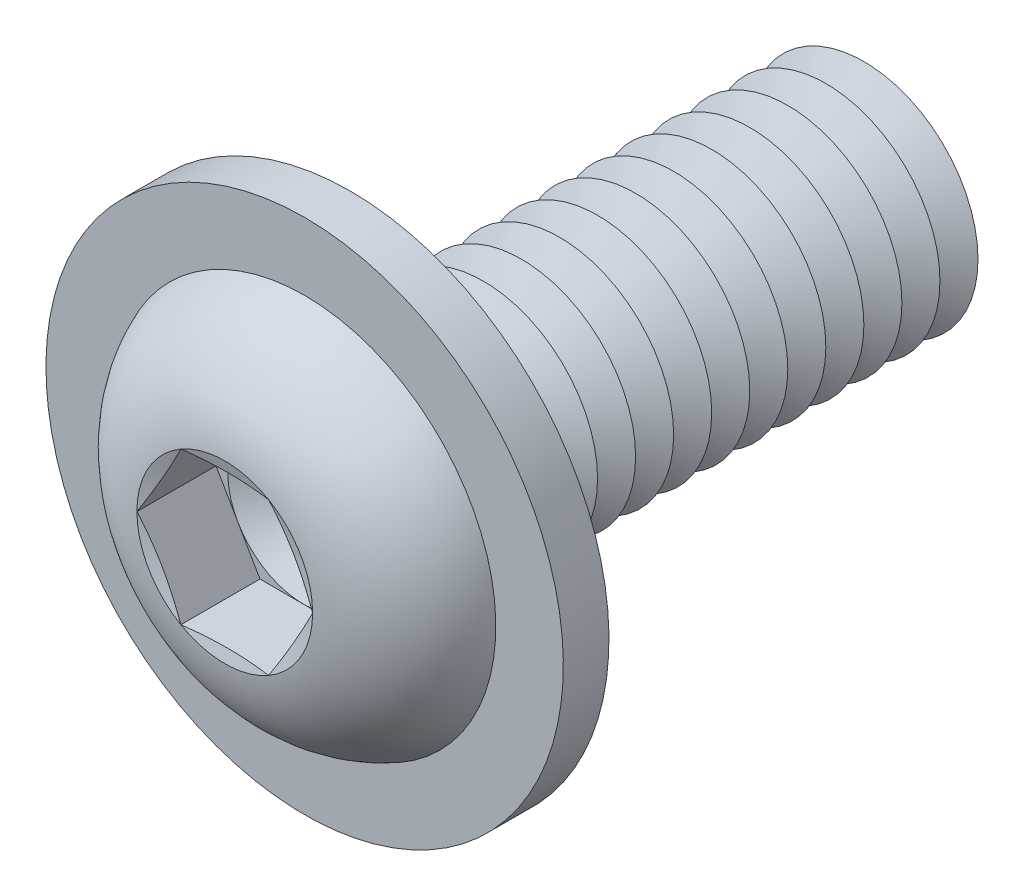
ISO-10303-21;
HEADER;
FILE_DESCRIPTION(('STEP AP214'),'2;1');
FILE_NAME('part.step','',(''),(''),'','','');
FILE_SCHEMA(('AUTOMOTIVE_DESIGN { 1 0 10303 214 1 1 1 1 }'));
ENDSEC;
DATA;
#1=APPLICATION_CONTEXT('core data for automotive mechanical design processes');
#2=APPLICATION_PROTOCOL_DEFINITION('international standard','automotive_design',2000,#1);
#3=PRODUCT_CONTEXT('',#1,'mechanical');
#4=PRODUCT('Part','Part','',(#3));
#5=PRODUCT_RELATED_PRODUCT_CATEGORY('part','',(#4));
#6=PRODUCT_DEFINITION_FORMATION('','',#4);
#7=PRODUCT_DEFINITION_CONTEXT('part definition',#1,'design');
#8=PRODUCT_DEFINITION('design','',#6,#7);
#9=PRODUCT_DEFINITION_SHAPE('','',#8);
#10=(LENGTH_UNIT() NAMED_UNIT(*) SI_UNIT(.MILLI.,.METRE.));
#11=(NAMED_UNIT(*) PLANE_ANGLE_UNIT() SI_UNIT($,.RADIAN.));
#12=(NAMED_UNIT(*) SI_UNIT($,.STERADIAN.) SOLID_ANGLE_UNIT());
#13=UNCERTAINTY_MEASURE_WITH_UNIT(LENGTH_MEASURE(1.E-05),#10,'distance_accuracy_value','');
#14=(GEOMETRIC_REPRESENTATION_CONTEXT(3) GLOBAL_UNCERTAINTY_ASSIGNED_CONTEXT((#13)) GLOBAL_UNIT_ASSIGNED_CONTEXT((#10,
#11,#12)) REPRESENTATION_CONTEXT('',''));
#15=CARTESIAN_POINT('',(0.,0.,0.));
#16=DIRECTION('',(0.,0.,1.));
#17=DIRECTION('',(1.,0.,0.));
#18=AXIS2_PLACEMENT_3D('',#15,#16,#17);
#19=CARTESIAN_POINT('',(0.,0.,-10.5));
#20=DIRECTION('',(0.,0.,1.));
#21=DIRECTION('',(1.,0.,0.));
#22=AXIS2_PLACEMENT_3D('',#19,#20,#21);
#23=CONICAL_SURFACE('',#22,3.,1.0471975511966);
#24=CARTESIAN_POINT('',(0.,0.,-11.));
#25=DIRECTION('',(0.,0.,1.));
#26=DIRECTION('',(1.,0.,0.));
#27=AXIS2_PLACEMENT_3D('',#24,#25,#26);
#28=CIRCLE('',#27,2.13397459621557);
#29=CARTESIAN_POINT('',(2.13397459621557,0.,-11.));
#30=VERTEX_POINT('',#29);
#31=EDGE_CURVE('E322',#30,#30,#28,.T.);
#32=ORIENTED_EDGE('',*,*,#31,.T.);
#33=EDGE_LOOP('',(#32));
#34=FACE_BOUND('',#33,.T.);
#35=CARTESIAN_POINT('',(0.,0.,-10.5));
#36=DIRECTION('',(0.,0.,1.));
#37=DIRECTION('',(1.,0.,0.));
#38=AXIS2_PLACEMENT_3D('',#35,#36,#37);
#39=CIRCLE('',#38,3.);
#40=CARTESIAN_POINT('',(3.,0.,-10.5));
#41=VERTEX_POINT('',#40);
#42=EDGE_CURVE('E318',#41,#41,#39,.T.);
#43=ORIENTED_EDGE('',*,*,#42,.F.);
#44=EDGE_LOOP('',(#43));
#45=FACE_BOUND('',#44,.T.);
#46=ADVANCED_FACE('F39',(#34,#45),#23,.T.);
#47=CARTESIAN_POINT('',(0.,0.,-11.));
#48=DIRECTION('',(0.,0.,-1.));
#49=DIRECTION('',(-1.,0.,0.));
#50=AXIS2_PLACEMENT_3D('',#47,#48,#49);
#51=CONICAL_SURFACE('',#50,2.13397459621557,1.0471975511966);
#52=CARTESIAN_POINT('',(0.,0.,-11.5));
#53=DIRECTION('',(0.,0.,1.));
#54=DIRECTION('',(1.,0.,0.));
#55=AXIS2_PLACEMENT_3D('',#52,#53,#54);
#56=CIRCLE('',#55,3.);
#57=CARTESIAN_POINT('',(3.,0.,-11.5));
#58=VERTEX_POINT('',#57);
#59=EDGE_CURVE('E326',#58,#58,#56,.T.);
#60=ORIENTED_EDGE('',*,*,#59,.T.);
#61=EDGE_LOOP('',(#60));
#62=FACE_BOUND('',#61,.T.);
#63=ORIENTED_EDGE('',*,*,#31,.F.);
#64=EDGE_LOOP('',(#63));
#65=FACE_BOUND('',#64,.T.);
#66=ADVANCED_FACE('F449',(#62,#65),#51,.T.);
#67=CARTESIAN_POINT('',(0.,3.00000000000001,-14.));
#68=DIRECTION('',(0.,0.,-1.));
#69=DIRECTION('',(-1.,0.,0.));
#70=AXIS2_PLACEMENT_3D('',#67,#68,#69);
#71=PLANE('',#70);
#72=CARTESIAN_POINT('',(0.,0.,-14.));
#73=DIRECTION('',(0.,0.,1.));
#74=DIRECTION('',(1.,0.,0.));
#75=AXIS2_PLACEMENT_3D('',#72,#73,#74);
#76=CIRCLE('',#75,2.13397459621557);
#77=CARTESIAN_POINT('',(2.13397459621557,0.,-14.));
#78=VERTEX_POINT('',#77);
#79=EDGE_CURVE('E346',#78,#78,#76,.T.);
#80=ORIENTED_EDGE('',*,*,#79,.F.);
#81=EDGE_LOOP('',(#80));
#82=FACE_BOUND('',#81,.T.);
#83=ADVANCED_FACE('F455',(#82),#71,.T.);
#84=CARTESIAN_POINT('',(0.,0.,-13.5));
#85=DIRECTION('',(0.,0.,1.));
#86=DIRECTION('',(1.,0.,0.));
#87=AXIS2_PLACEMENT_3D('',#84,#85,#86);
#88=CONICAL_SURFACE('',#87,3.,1.0471975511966);
#89=ORIENTED_EDGE('',*,*,#79,.T.);
#90=EDGE_LOOP('',(#89));
#91=FACE_BOUND('',#90,.T.);
#92=CARTESIAN_POINT('',(0.,0.,-13.5));
#93=DIRECTION('',(0.,0.,1.));
#94=DIRECTION('',(1.,0.,0.));
#95=AXIS2_PLACEMENT_3D('',#92,#93,#94);
#96=CIRCLE('',#95,3.);
#97=CARTESIAN_POINT('',(3.,0.,-13.5));
#98=VERTEX_POINT('',#97);
#99=EDGE_CURVE('E342',#98,#98,#96,.T.);
#100=ORIENTED_EDGE('',*,*,#99,.F.);
#101=EDGE_LOOP('',(#100));
#102=FACE_BOUND('',#101,.T.);
#103=ADVANCED_FACE('F474',(#91,#102),#88,.T.);
#104=CARTESIAN_POINT('',(0.,0.,-13.));
#105=DIRECTION('',(0.,0.,-1.));
#106=DIRECTION('',(-1.,0.,0.));
#107=AXIS2_PLACEMENT_3D('',#104,#105,#106);
#108=CONICAL_SURFACE('',#107,2.13397459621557,1.0471975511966);
#109=ORIENTED_EDGE('',*,*,#99,.T.);
#110=EDGE_LOOP('',(#109));
#111=FACE_BOUND('',#110,.T.);
#112=CARTESIAN_POINT('',(0.,0.,-13.));
#113=DIRECTION('',(0.,0.,1.));
#114=DIRECTION('',(1.,0.,0.));
#115=AXIS2_PLACEMENT_3D('',#112,#113,#114);
#116=CIRCLE('',#115,2.13397459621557);
#117=CARTESIAN_POINT('',(2.13397459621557,0.,-13.));
#118=VERTEX_POINT('',#117);
#119=EDGE_CURVE('E338',#118,#118,#116,.T.);
#120=ORIENTED_EDGE('',*,*,#119,.F.);
#121=EDGE_LOOP('',(#120));
#122=FACE_BOUND('',#121,.T.);
#123=ADVANCED_FACE('F471',(#111,#122),#108,.T.);
#124=CARTESIAN_POINT('',(0.,0.,-12.5));
#125=DIRECTION('',(0.,0.,1.));
#126=DIRECTION('',(1.,0.,0.));
#127=AXIS2_PLACEMENT_3D('',#124,#125,#126);
#128=CONICAL_SURFACE('',#127,3.,1.0471975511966);
#129=ORIENTED_EDGE('',*,*,#119,.T.);
#130=EDGE_LOOP('',(#129));
#131=FACE_BOUND('',#130,.T.);
#132=CARTESIAN_POINT('',(0.,0.,-12.5));
#133=DIRECTION('',(0.,0.,1.));
#134=DIRECTION('',(1.,0.,0.));
#135=AXIS2_PLACEMENT_3D('',#132,#133,#134);
#136=CIRCLE('',#135,3.);
#137=CARTESIAN_POINT('',(3.,0.,-12.5));
#138=VERTEX_POINT('',#137);
#139=EDGE_CURVE('E334',#138,#138,#136,.T.);
#140=ORIENTED_EDGE('',*,*,#139,.F.);
#141=EDGE_LOOP('',(#140));
#142=FACE_BOUND('',#141,.T.);
#143=ADVANCED_FACE('F465',(#131,#142),#128,.T.);
#144=CARTESIAN_POINT('',(0.,0.,-12.));
#145=DIRECTION('',(0.,0.,-1.));
#146=DIRECTION('',(-1.,0.,0.));
#147=AXIS2_PLACEMENT_3D('',#144,#145,#146);
#148=CONICAL_SURFACE('',#147,2.13397459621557,1.0471975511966);
#149=ORIENTED_EDGE('',*,*,#139,.T.);
#150=EDGE_LOOP('',(#149));
#151=FACE_BOUND('',#150,.T.);
#152=CARTESIAN_POINT('',(0.,0.,-12.));
#153=DIRECTION('',(0.,0.,1.));
#154=DIRECTION('',(1.,0.,0.));
#155=AXIS2_PLACEMENT_3D('',#152,#153,#154);
#156=CIRCLE('',#155,2.13397459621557);
#157=CARTESIAN_POINT('',(2.13397459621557,0.,-12.));
#158=VERTEX_POINT('',#157);
#159=EDGE_CURVE('E330',#158,#158,#156,.T.);
#160=ORIENTED_EDGE('',*,*,#159,.F.);
#161=EDGE_LOOP('',(#160));
#162=FACE_BOUND('',#161,.T.);
#163=ADVANCED_FACE('F461',(#151,#162),#148,.T.);
#164=CARTESIAN_POINT('',(0.,0.,-11.5));
#165=DIRECTION('',(0.,0.,1.));
#166=DIRECTION('',(1.,0.,0.));
#167=AXIS2_PLACEMENT_3D('',#164,#165,#166);
#168=CONICAL_SURFACE('',#167,3.,1.0471975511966);
#169=ORIENTED_EDGE('',*,*,#159,.T.);
#170=EDGE_LOOP('',(#169));
#171=FACE_BOUND('',#170,.T.);
#172=ORIENTED_EDGE('',*,*,#59,.F.);
#173=EDGE_LOOP('',(#172));
#174=FACE_BOUND('',#173,.T.);
#175=ADVANCED_FACE('F464',(#171,#174),#168,.T.);
#176=CARTESIAN_POINT('',(0.,0.,-9.5));
#177=DIRECTION('',(0.,0.,1.));
#178=DIRECTION('',(1.,0.,0.));
#179=AXIS2_PLACEMENT_3D('',#176,#177,#178);
#180=CONICAL_SURFACE('',#179,3.,1.0471975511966);
#181=CARTESIAN_POINT('',(0.,0.,-10.));
#182=DIRECTION('',(0.,0.,1.));
#183=DIRECTION('',(1.,0.,0.));
#184=AXIS2_PLACEMENT_3D('',#181,#182,#183);
#185=CIRCLE('',#184,2.13397459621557);
#186=CARTESIAN_POINT('',(2.13397459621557,0.,-10.));
#187=VERTEX_POINT('',#186);
#188=EDGE_CURVE('E314',#187,#187,#185,.T.);
#189=ORIENTED_EDGE('',*,*,#188,.T.);
#190=EDGE_LOOP('',(#189));
#191=FACE_BOUND('',#190,.T.);
#192=CARTESIAN_POINT('',(0.,0.,-9.5));
#193=DIRECTION('',(0.,0.,1.));
#194=DIRECTION('',(1.,0.,0.));
#195=AXIS2_PLACEMENT_3D('',#192,#193,#194);
#196=CIRCLE('',#195,3.);
#197=CARTESIAN_POINT('',(3.,0.,-9.5));
#198=VERTEX_POINT('',#197);
#199=EDGE_CURVE('E310',#198,#198,#196,.T.);
#200=ORIENTED_EDGE('',*,*,#199,.F.);
#201=EDGE_LOOP('',(#200));
#202=FACE_BOUND('',#201,.T.);
#203=ADVANCED_FACE('F469',(#191,#202),#180,.T.);
#204=CARTESIAN_POINT('',(0.,0.,-10.));
#205=DIRECTION('',(0.,0.,-1.));
#206=DIRECTION('',(-1.,0.,0.));
#207=AXIS2_PLACEMENT_3D('',#204,#205,#206);
#208=CONICAL_SURFACE('',#207,2.13397459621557,1.0471975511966);
#209=ORIENTED_EDGE('',*,*,#42,.T.);
#210=EDGE_LOOP('',(#209));
#211=FACE_BOUND('',#210,.T.);
#212=ORIENTED_EDGE('',*,*,#188,.F.);
#213=EDGE_LOOP('',(#212));
#214=FACE_BOUND('',#213,.T.);
#215=ADVANCED_FACE('F520',(#211,#214),#208,.T.);
#216=CARTESIAN_POINT('',(0.,0.,-8.5));
#217=DIRECTION('',(0.,0.,1.));
#218=DIRECTION('',(1.,0.,0.));
#219=AXIS2_PLACEMENT_3D('',#216,#217,#218);
#220=CONICAL_SURFACE('',#219,3.,1.0471975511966);
#221=CARTESIAN_POINT('',(0.,0.,-9.));
#222=DIRECTION('',(0.,0.,1.));
#223=DIRECTION('',(1.,0.,0.));
#224=AXIS2_PLACEMENT_3D('',#221,#222,#223);
#225=CIRCLE('',#224,2.13397459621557);
#226=CARTESIAN_POINT('',(2.13397459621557,0.,-9.));
#227=VERTEX_POINT('',#226);
#228=EDGE_CURVE('E306',#227,#227,#225,.T.);
#229=ORIENTED_EDGE('',*,*,#228,.T.);
#230=EDGE_LOOP('',(#229));
#231=FACE_BOUND('',#230,.T.);
#232=CARTESIAN_POINT('',(0.,0.,-8.5));
#233=DIRECTION('',(0.,0.,1.));
#234=DIRECTION('',(1.,0.,0.));
#235=AXIS2_PLACEMENT_3D('',#232,#233,#234);
#236=CIRCLE('',#235,3.);
#237=CARTESIAN_POINT('',(3.,0.,-8.5));
#238=VERTEX_POINT('',#237);
#239=EDGE_CURVE('E302',#238,#238,#236,.T.);
#240=ORIENTED_EDGE('',*,*,#239,.F.);
#241=EDGE_LOOP('',(#240));
#242=FACE_BOUND('',#241,.T.);
#243=ADVANCED_FACE('F526',(#231,#242),#220,.T.);
#244=CARTESIAN_POINT('',(0.,0.,-9.));
#245=DIRECTION('',(0.,0.,-1.));
#246=DIRECTION('',(-1.,0.,0.));
#247=AXIS2_PLACEMENT_3D('',#244,#245,#246);
#248=CONICAL_SURFACE('',#247,2.13397459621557,1.0471975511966);
#249=ORIENTED_EDGE('',*,*,#199,.T.);
#250=EDGE_LOOP('',(#249));
#251=FACE_BOUND('',#250,.T.);
#252=ORIENTED_EDGE('',*,*,#228,.F.);
#253=EDGE_LOOP('',(#252));
#254=FACE_BOUND('',#253,.T.);
#255=ADVANCED_FACE('F533',(#251,#254),#248,.T.);
#256=CARTESIAN_POINT('',(0.,0.,-7.5));
#257=DIRECTION('',(0.,0.,1.));
#258=DIRECTION('',(1.,0.,0.));
#259=AXIS2_PLACEMENT_3D('',#256,#257,#258);
#260=CONICAL_SURFACE('',#259,3.,1.0471975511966);
#261=CARTESIAN_POINT('',(0.,0.,-8.));
#262=DIRECTION('',(0.,0.,1.));
#263=DIRECTION('',(1.,0.,0.));
#264=AXIS2_PLACEMENT_3D('',#261,#262,#263);
#265=CIRCLE('',#264,2.13397459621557);
#266=CARTESIAN_POINT('',(2.13397459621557,0.,-8.));
#267=VERTEX_POINT('',#266);
#268=EDGE_CURVE('E298',#267,#267,#265,.T.);
#269=ORIENTED_EDGE('',*,*,#268,.T.);
#270=EDGE_LOOP('',(#269));
#271=FACE_BOUND('',#270,.T.);
#272=CARTESIAN_POINT('',(0.,0.,-7.5));
#273=DIRECTION('',(0.,0.,1.));
#274=DIRECTION('',(1.,0.,0.));
#275=AXIS2_PLACEMENT_3D('',#272,#273,#274);
#276=CIRCLE('',#275,3.);
#277=CARTESIAN_POINT('',(3.,0.,-7.5));
#278=VERTEX_POINT('',#277);
#279=EDGE_CURVE('E294',#278,#278,#276,.T.);
#280=ORIENTED_EDGE('',*,*,#279,.F.);
#281=EDGE_LOOP('',(#280));
#282=FACE_BOUND('',#281,.T.);
#283=ADVANCED_FACE('F540',(#271,#282),#260,.T.);
#284=CARTESIAN_POINT('',(0.,0.,-8.));
#285=DIRECTION('',(0.,0.,-1.));
#286=DIRECTION('',(-1.,0.,0.));
#287=AXIS2_PLACEMENT_3D('',#284,#285,#286);
#288=CONICAL_SURFACE('',#287,2.13397459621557,1.0471975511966);
#289=ORIENTED_EDGE('',*,*,#239,.T.);
#290=EDGE_LOOP('',(#289));
#291=FACE_BOUND('',#290,.T.);
#292=ORIENTED_EDGE('',*,*,#268,.F.);
#293=EDGE_LOOP('',(#292));
#294=FACE_BOUND('',#293,.T.);
#295=ADVANCED_FACE('F547',(#291,#294),#288,.T.);
#296=CARTESIAN_POINT('',(0.,0.,-6.5));
#297=DIRECTION('',(0.,0.,1.));
#298=DIRECTION('',(1.,0.,0.));
#299=AXIS2_PLACEMENT_3D('',#296,#297,#298);
#300=CONICAL_SURFACE('',#299,3.,1.0471975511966);
#301=CARTESIAN_POINT('',(0.,0.,-7.));
#302=DIRECTION('',(0.,0.,1.));
#303=DIRECTION('',(1.,0.,0.));
#304=AXIS2_PLACEMENT_3D('',#301,#302,#303);
#305=CIRCLE('',#304,2.13397459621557);
#306=CARTESIAN_POINT('',(2.13397459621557,0.,-7.));
#307=VERTEX_POINT('',#306);
#308=EDGE_CURVE('E290',#307,#307,#305,.T.);
#309=ORIENTED_EDGE('',*,*,#308,.T.);
#310=EDGE_LOOP('',(#309));
#311=FACE_BOUND('',#310,.T.);
#312=CARTESIAN_POINT('',(0.,0.,-6.5));
#313=DIRECTION('',(0.,0.,1.));
#314=DIRECTION('',(1.,0.,0.));
#315=AXIS2_PLACEMENT_3D('',#312,#313,#314);
#316=CIRCLE('',#315,3.);
#317=CARTESIAN_POINT('',(3.,0.,-6.5));
#318=VERTEX_POINT('',#317);
#319=EDGE_CURVE('E286',#318,#318,#316,.T.);
#320=ORIENTED_EDGE('',*,*,#319,.F.);
#321=EDGE_LOOP('',(#320));
#322=FACE_BOUND('',#321,.T.);
#323=ADVANCED_FACE('F554',(#311,#322),#300,.T.);
#324=CARTESIAN_POINT('',(0.,0.,-7.));
#325=DIRECTION('',(0.,0.,-1.));
#326=DIRECTION('',(-1.,0.,0.));
#327=AXIS2_PLACEMENT_3D('',#324,#325,#326);
#328=CONICAL_SURFACE('',#327,2.13397459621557,1.0471975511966);
#329=ORIENTED_EDGE('',*,*,#279,.T.);
#330=EDGE_LOOP('',(#329));
#331=FACE_BOUND('',#330,.T.);
#332=ORIENTED_EDGE('',*,*,#308,.F.);
#333=EDGE_LOOP('',(#332));
#334=FACE_BOUND('',#333,.T.);
#335=ADVANCED_FACE('F561',(#331,#334),#328,.T.);
#336=CARTESIAN_POINT('',(0.,0.,-5.5));
#337=DIRECTION('',(0.,0.,1.));
#338=DIRECTION('',(1.,0.,0.));
#339=AXIS2_PLACEMENT_3D('',#336,#337,#338);
#340=CONICAL_SURFACE('',#339,3.,1.0471975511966);
#341=CARTESIAN_POINT('',(0.,0.,-6.));
#342=DIRECTION('',(0.,0.,1.));
#343=DIRECTION('',(1.,0.,0.));
#344=AXIS2_PLACEMENT_3D('',#341,#342,#343);
#345=CIRCLE('',#344,2.13397459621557);
#346=CARTESIAN_POINT('',(2.13397459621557,0.,-6.));
#347=VERTEX_POINT('',#346);
#348=EDGE_CURVE('E282',#347,#347,#345,.T.);
#349=ORIENTED_EDGE('',*,*,#348,.T.);
#350=EDGE_LOOP('',(#349));
#351=FACE_BOUND('',#350,.T.);
#352=CARTESIAN_POINT('',(0.,0.,-5.5));
#353=DIRECTION('',(0.,0.,1.));
#354=DIRECTION('',(1.,0.,0.));
#355=AXIS2_PLACEMENT_3D('',#352,#353,#354);
#356=CIRCLE('',#355,3.);
#357=CARTESIAN_POINT('',(3.,0.,-5.5));
#358=VERTEX_POINT('',#357);
#359=EDGE_CURVE('E278',#358,#358,#356,.T.);
#360=ORIENTED_EDGE('',*,*,#359,.F.);
#361=EDGE_LOOP('',(#360));
#362=FACE_BOUND('',#361,.T.);
#363=ADVANCED_FACE('F568',(#351,#362),#340,.T.);
#364=CARTESIAN_POINT('',(0.,0.,-6.));
#365=DIRECTION('',(0.,0.,-1.));
#366=DIRECTION('',(-1.,0.,0.));
#367=AXIS2_PLACEMENT_3D('',#364,#365,#366);
#368=CONICAL_SURFACE('',#367,2.13397459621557,1.0471975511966);
#369=ORIENTED_EDGE('',*,*,#319,.T.);
#370=EDGE_LOOP('',(#369));
#371=FACE_BOUND('',#370,.T.);
#372=ORIENTED_EDGE('',*,*,#348,.F.);
#373=EDGE_LOOP('',(#372));
#374=FACE_BOUND('',#373,.T.);
#375=ADVANCED_FACE('F575',(#371,#374),#368,.T.);
#376=CARTESIAN_POINT('',(0.,0.,-4.5));
#377=DIRECTION('',(0.,0.,1.));
#378=DIRECTION('',(1.,0.,0.));
#379=AXIS2_PLACEMENT_3D('',#376,#377,#378);
#380=CONICAL_SURFACE('',#379,3.,1.0471975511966);
#381=CARTESIAN_POINT('',(0.,0.,-5.));
#382=DIRECTION('',(0.,0.,1.));
#383=DIRECTION('',(1.,0.,0.));
#384=AXIS2_PLACEMENT_3D('',#381,#382,#383);
#385=CIRCLE('',#384,2.13397459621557);
#386=CARTESIAN_POINT('',(2.13397459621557,0.,-5.));
#387=VERTEX_POINT('',#386);
#388=EDGE_CURVE('E274',#387,#387,#385,.T.);
#389=ORIENTED_EDGE('',*,*,#388,.T.);
#390=EDGE_LOOP('',(#389));
#391=FACE_BOUND('',#390,.T.);
#392=CARTESIAN_POINT('',(0.,0.,-4.5));
#393=DIRECTION('',(0.,0.,1.));
#394=DIRECTION('',(1.,0.,0.));
#395=AXIS2_PLACEMENT_3D('',#392,#393,#394);
#396=CIRCLE('',#395,3.);
#397=CARTESIAN_POINT('',(3.,0.,-4.5));
#398=VERTEX_POINT('',#397);
#399=EDGE_CURVE('E270',#398,#398,#396,.T.);
#400=ORIENTED_EDGE('',*,*,#399,.F.);
#401=EDGE_LOOP('',(#400));
#402=FACE_BOUND('',#401,.T.);
#403=ADVANCED_FACE('F582',(#391,#402),#380,.T.);
#404=CARTESIAN_POINT('',(0.,0.,-5.));
#405=DIRECTION('',(0.,0.,-1.));
#406=DIRECTION('',(-1.,0.,0.));
#407=AXIS2_PLACEMENT_3D('',#404,#405,#406);
#408=CONICAL_SURFACE('',#407,2.13397459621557,1.0471975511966);
#409=ORIENTED_EDGE('',*,*,#359,.T.);
#410=EDGE_LOOP('',(#409));
#411=FACE_BOUND('',#410,.T.);
#412=ORIENTED_EDGE('',*,*,#388,.F.);
#413=EDGE_LOOP('',(#412));
#414=FACE_BOUND('',#413,.T.);
#415=ADVANCED_FACE('F589',(#411,#414),#408,.T.);
#416=CARTESIAN_POINT('',(0.,0.,-3.5));
#417=DIRECTION('',(0.,0.,1.));
#418=DIRECTION('',(1.,0.,0.));
#419=AXIS2_PLACEMENT_3D('',#416,#417,#418);
#420=CONICAL_SURFACE('',#419,3.,1.0471975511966);
#421=CARTESIAN_POINT('',(0.,0.,-4.));
#422=DIRECTION('',(0.,0.,1.));
#423=DIRECTION('',(1.,0.,0.));
#424=AXIS2_PLACEMENT_3D('',#421,#422,#423);
#425=CIRCLE('',#424,2.13397459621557);
#426=CARTESIAN_POINT('',(2.13397459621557,0.,-4.));
#427=VERTEX_POINT('',#426);
#428=EDGE_CURVE('E266',#427,#427,#425,.T.);
#429=ORIENTED_EDGE('',*,*,#428,.T.);
#430=EDGE_LOOP('',(#429));
#431=FACE_BOUND('',#430,.T.);
#432=CARTESIAN_POINT('',(0.,0.,-3.5));
#433=DIRECTION('',(0.,0.,1.));
#434=DIRECTION('',(1.,0.,0.));
#435=AXIS2_PLACEMENT_3D('',#432,#433,#434);
#436=CIRCLE('',#435,3.);
#437=CARTESIAN_POINT('',(3.,0.,-3.5));
#438=VERTEX_POINT('',#437);
#439=EDGE_CURVE('E262',#438,#438,#436,.T.);
#440=ORIENTED_EDGE('',*,*,#439,.F.);
#441=EDGE_LOOP('',(#440));
#442=FACE_BOUND('',#441,.T.);
#443=ADVANCED_FACE('F596',(#431,#442),#420,.T.);
#444=CARTESIAN_POINT('',(0.,0.,-4.));
#445=DIRECTION('',(0.,0.,-1.));
#446=DIRECTION('',(-1.,0.,0.));
#447=AXIS2_PLACEMENT_3D('',#444,#445,#446);
#448=CONICAL_SURFACE('',#447,2.13397459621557,1.0471975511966);
#449=ORIENTED_EDGE('',*,*,#399,.T.);
#450=EDGE_LOOP('',(#449));
#451=FACE_BOUND('',#450,.T.);
#452=ORIENTED_EDGE('',*,*,#428,.F.);
#453=EDGE_LOOP('',(#452));
#454=FACE_BOUND('',#453,.T.);
#455=ADVANCED_FACE('F603',(#451,#454),#448,.T.);
#456=CARTESIAN_POINT('',(0.,0.,-2.5));
#457=DIRECTION('',(0.,0.,1.));
#458=DIRECTION('',(1.,0.,0.));
#459=AXIS2_PLACEMENT_3D('',#456,#457,#458);
#460=CONICAL_SURFACE('',#459,3.,1.0471975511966);
#461=CARTESIAN_POINT('',(0.,0.,-3.));
#462=DIRECTION('',(0.,0.,1.));
#463=DIRECTION('',(1.,0.,0.));
#464=AXIS2_PLACEMENT_3D('',#461,#462,#463);
#465=CIRCLE('',#464,2.13397459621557);
#466=CARTESIAN_POINT('',(2.13397459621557,0.,-3.));
#467=VERTEX_POINT('',#466);
#468=EDGE_CURVE('E258',#467,#467,#465,.T.);
#469=ORIENTED_EDGE('',*,*,#468,.T.);
#470=EDGE_LOOP('',(#469));
#471=FACE_BOUND('',#470,.T.);
#472=CARTESIAN_POINT('',(0.,0.,-2.5));
#473=DIRECTION('',(0.,0.,1.));
#474=DIRECTION('',(1.,0.,0.));
#475=AXIS2_PLACEMENT_3D('',#472,#473,#474);
#476=CIRCLE('',#475,3.);
#477=CARTESIAN_POINT('',(3.,0.,-2.5));
#478=VERTEX_POINT('',#477);
#479=EDGE_CURVE('E254',#478,#478,#476,.T.);
#480=ORIENTED_EDGE('',*,*,#479,.F.);
#481=EDGE_LOOP('',(#480));
#482=FACE_BOUND('',#481,.T.);
#483=ADVANCED_FACE('F610',(#471,#482),#460,.T.);
#484=CARTESIAN_POINT('',(0.,0.,-3.));
#485=DIRECTION('',(0.,0.,-1.));
#486=DIRECTION('',(-1.,0.,0.));
#487=AXIS2_PLACEMENT_3D('',#484,#485,#486);
#488=CONICAL_SURFACE('',#487,2.13397459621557,1.0471975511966);
#489=ORIENTED_EDGE('',*,*,#439,.T.);
#490=EDGE_LOOP('',(#489));
#491=FACE_BOUND('',#490,.T.);
#492=ORIENTED_EDGE('',*,*,#468,.F.);
#493=EDGE_LOOP('',(#492));
#494=FACE_BOUND('',#493,.T.);
#495=ADVANCED_FACE('F617',(#491,#494),#488,.T.);
#496=CARTESIAN_POINT('',(0.,0.,-1.5));
#497=DIRECTION('',(0.,0.,1.));
#498=DIRECTION('',(1.,0.,0.));
#499=AXIS2_PLACEMENT_3D('',#496,#497,#498);
#500=CONICAL_SURFACE('',#499,3.,1.0471975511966);
#501=CARTESIAN_POINT('',(0.,0.,-2.));
#502=DIRECTION('',(0.,0.,1.));
#503=DIRECTION('',(1.,0.,0.));
#504=AXIS2_PLACEMENT_3D('',#501,#502,#503);
#505=CIRCLE('',#504,2.13397459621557);
#506=CARTESIAN_POINT('',(2.13397459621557,0.,-2.));
#507=VERTEX_POINT('',#506);
#508=EDGE_CURVE('E250',#507,#507,#505,.T.);
#509=ORIENTED_EDGE('',*,*,#508,.T.);
#510=EDGE_LOOP('',(#509));
#511=FACE_BOUND('',#510,.T.);
#512=CARTESIAN_POINT('',(0.,0.,-1.5));
#513=DIRECTION('',(0.,0.,1.));
#514=DIRECTION('',(1.,0.,0.));
#515=AXIS2_PLACEMENT_3D('',#512,#513,#514);
#516=CIRCLE('',#515,3.);
#517=CARTESIAN_POINT('',(3.,0.,-1.5));
#518=VERTEX_POINT('',#517);
#519=EDGE_CURVE('E242',#518,#518,#516,.T.);
#520=ORIENTED_EDGE('',*,*,#519,.F.);
#521=EDGE_LOOP('',(#520));
#522=FACE_BOUND('',#521,.T.);
#523=ADVANCED_FACE('F624',(#511,#522),#500,.T.);
#524=CARTESIAN_POINT('',(0.,0.,-2.));
#525=DIRECTION('',(0.,0.,-1.));
#526=DIRECTION('',(-1.,0.,0.));
#527=AXIS2_PLACEMENT_3D('',#524,#525,#526);
#528=CONICAL_SURFACE('',#527,2.13397459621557,1.0471975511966);
#529=ORIENTED_EDGE('',*,*,#479,.T.);
#530=EDGE_LOOP('',(#529));
#531=FACE_BOUND('',#530,.T.);
#532=ORIENTED_EDGE('',*,*,#508,.F.);
#533=EDGE_LOOP('',(#532));
#534=FACE_BOUND('',#533,.T.);
#535=ADVANCED_FACE('F631',(#531,#534),#528,.T.);
#536=CARTESIAN_POINT('',(0.,0.,-0.499999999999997));
#537=DIRECTION('',(0.,0.,1.));
#538=DIRECTION('',(1.,0.,0.));
#539=AXIS2_PLACEMENT_3D('',#536,#537,#538);
#540=CONICAL_SURFACE('',#539,3.,1.0471975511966);
#541=CARTESIAN_POINT('',(0.,0.,-0.999999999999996));
#542=DIRECTION('',(0.,0.,1.));
#543=DIRECTION('',(1.,0.,0.));
#544=AXIS2_PLACEMENT_3D('',#541,#542,#543);
#545=CIRCLE('',#544,2.13397459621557);
#546=CARTESIAN_POINT('',(2.13397459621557,0.,-0.999999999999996));
#547=VERTEX_POINT('',#546);
#548=EDGE_CURVE('E232',#547,#547,#545,.T.);
#549=ORIENTED_EDGE('',*,*,#548,.T.);
#550=EDGE_LOOP('',(#549));
#551=FACE_BOUND('',#550,.T.);
#552=CARTESIAN_POINT('',(0.,0.,-0.499999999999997));
#553=DIRECTION('',(0.,0.,1.));
#554=DIRECTION('',(1.,0.,0.));
#555=AXIS2_PLACEMENT_3D('',#552,#553,#554);
#556=CIRCLE('',#555,3.);
#557=CARTESIAN_POINT('',(3.,0.,-0.499999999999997));
#558=VERTEX_POINT('',#557);
#559=EDGE_CURVE('E246',#558,#558,#556,.T.);
#560=ORIENTED_EDGE('',*,*,#559,.F.);
#561=EDGE_LOOP('',(#560));
#562=FACE_BOUND('',#561,.T.);
#563=ADVANCED_FACE('F638',(#551,#562),#540,.T.);
#564=CARTESIAN_POINT('',(0.,0.,-0.999999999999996));
#565=DIRECTION('',(0.,0.,-1.));
#566=DIRECTION('',(-1.,0.,0.));
#567=AXIS2_PLACEMENT_3D('',#564,#565,#566);
#568=CONICAL_SURFACE('',#567,2.13397459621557,1.0471975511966);
#569=ORIENTED_EDGE('',*,*,#519,.T.);
#570=EDGE_LOOP('',(#569));
#571=FACE_BOUND('',#570,.T.);
#572=ORIENTED_EDGE('',*,*,#548,.F.);
#573=EDGE_LOOP('',(#572));
#574=FACE_BOUND('',#573,.T.);
#575=ADVANCED_FACE('F221',(#571,#574),#568,.T.);
#576=CARTESIAN_POINT('',(0.,3.,0.));
#577=DIRECTION('',(0.,0.,-1.));
#578=DIRECTION('',(-1.,0.,0.));
#579=AXIS2_PLACEMENT_3D('',#576,#577,#578);
#580=PLANE('',#579);
#581=CARTESIAN_POINT('',(0.,0.,0.));
#582=DIRECTION('',(0.,0.,-1.));
#583=DIRECTION('',(-1.,0.,0.));
#584=AXIS2_PLACEMENT_3D('',#581,#582,#583);
#585=CIRCLE('',#584,3.5);
#586=CARTESIAN_POINT('',(-3.5,0.,0.));
#587=VERTEX_POINT('',#586);
#588=EDGE_CURVE('E355',#587,#587,#585,.F.);
#589=ORIENTED_EDGE('',*,*,#588,.T.);
#590=EDGE_LOOP('',(#589));
#591=FACE_BOUND('',#590,.T.);
#592=CARTESIAN_POINT('',(0.,0.,0.));
#593=DIRECTION('',(0.,0.,-1.));
#594=DIRECTION('',(0.,1.,0.));
#595=AXIS2_PLACEMENT_3D('',#592,#593,#594);
#596=CIRCLE('',#595,6.8);
#597=CARTESIAN_POINT('',(0.,6.8,0.));
#598=VERTEX_POINT('',#597);
#599=EDGE_CURVE('E414',#598,#598,#596,.T.);
#600=ORIENTED_EDGE('',*,*,#599,.T.);
#601=EDGE_LOOP('',(#600));
#602=FACE_BOUND('',#601,.T.);
#603=ADVANCED_FACE('F650',(#591,#602),#580,.T.);
#604=CARTESIAN_POINT('',(0.,0.,-0.5));
#605=DIRECTION('',(0.,0.,-1.));
#606=DIRECTION('',(-1.,0.,0.));
#607=AXIS2_PLACEMENT_3D('',#604,#605,#606);
#608=TOROIDAL_SURFACE('',#607,3.5,0.5);
#609=ORIENTED_EDGE('',*,*,#588,.F.);
#610=EDGE_LOOP('',(#609));
#611=FACE_BOUND('',#610,.T.);
#612=ORIENTED_EDGE('',*,*,#559,.T.);
#613=EDGE_LOOP('',(#612));
#614=FACE_BOUND('',#613,.T.);
#615=ADVANCED_FACE('F41',(#611,#614),#608,.F.);
#616=CARTESIAN_POINT('',(0.,0.,1.2));
#617=DIRECTION('',(0.,0.,-1.));
#618=DIRECTION('',(0.,1.,0.));
#619=AXIS2_PLACEMENT_3D('',#616,#617,#618);
#620=CYLINDRICAL_SURFACE('',#619,6.8);
#621=CARTESIAN_POINT('',(0.,0.,1.2));
#622=DIRECTION('',(0.,0.,-1.));
#623=DIRECTION('',(0.,1.,0.));
#624=AXIS2_PLACEMENT_3D('',#621,#622,#623);
#625=CIRCLE('',#624,6.8);
#626=CARTESIAN_POINT('',(0.,6.8,1.2));
#627=VERTEX_POINT('',#626);
#628=EDGE_CURVE('E416',#627,#627,#625,.T.);
#629=ORIENTED_EDGE('',*,*,#628,.T.);
#630=EDGE_LOOP('',(#629));
#631=FACE_BOUND('',#630,.T.);
#632=ORIENTED_EDGE('',*,*,#599,.F.);
#633=EDGE_LOOP('',(#632));
#634=FACE_BOUND('',#633,.T.);
#635=ADVANCED_FACE('F661',(#631,#634),#620,.T.);
#636=CARTESIAN_POINT('',(0.,0.,1.2));
#637=DIRECTION('',(0.,0.,-1.));
#638=DIRECTION('',(0.,1.,0.));
#639=AXIS2_PLACEMENT_3D('',#636,#637,#638);
#640=PLANE('',#639);
#641=CARTESIAN_POINT('',(0.,0.,1.2));
#642=DIRECTION('',(0.,0.,-1.));
#643=DIRECTION('',(0.,1.,0.));
#644=AXIS2_PLACEMENT_3D('',#641,#642,#643);
#645=CIRCLE('',#644,5.02568742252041);
#646=CARTESIAN_POINT('',(0.,5.02568742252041,1.2));
#647=VERTEX_POINT('',#646);
#648=EDGE_CURVE('E43',#647,#647,#645,.F.);
#649=ORIENTED_EDGE('',*,*,#648,.F.);
#650=EDGE_LOOP('',(#649));
#651=FACE_BOUND('',#650,.T.);
#652=ORIENTED_EDGE('',*,*,#628,.F.);
#653=EDGE_LOOP('',(#652));
#654=FACE_BOUND('',#653,.T.);
#655=ADVANCED_FACE('F117',(#651,#654),#640,.F.);
#656=CARTESIAN_POINT('',(0.,0.,1.22));
#657=DIRECTION('',(0.,0.,1.));
#658=DIRECTION('',(1.,0.,0.));
#659=AXIS2_PLACEMENT_3D('',#656,#657,#658);
#660=CONICAL_SURFACE('',#659,1.99999906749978,1.0471975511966);
#661=CARTESIAN_POINT('',(0.,0.,0.0653000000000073));
#662=VERTEX_POINT('',#661);
#663=VERTEX_LOOP('',#662);
#664=FACE_BOUND('',#663,.T.);
#665=CARTESIAN_POINT('',(0.,0.,1.22));
#666=DIRECTION('',(0.,0.,1.));
#667=DIRECTION('',(1.,0.,0.));
#668=AXIS2_PLACEMENT_3D('',#665,#666,#667);
#669=CIRCLE('',#668,1.99999906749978);
#670=CARTESIAN_POINT('',(1.73205,0.999999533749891,1.22));
#671=VERTEX_POINT('',#670);
#672=CARTESIAN_POINT('',(0.,1.99999906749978,1.22));
#673=VERTEX_POINT('',#672);
#674=EDGE_CURVE('E120',#671,#673,#669,.T.);
#675=ORIENTED_EDGE('',*,*,#674,.T.);
#676=CARTESIAN_POINT('',(0.,0.,1.22));
#677=DIRECTION('',(0.,0.,1.));
#678=DIRECTION('',(1.,0.,0.));
#679=AXIS2_PLACEMENT_3D('',#676,#677,#678);
#680=CIRCLE('',#679,1.99999906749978);
#681=CARTESIAN_POINT('',(-1.73205,0.999999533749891,1.22));
#682=VERTEX_POINT('',#681);
#683=EDGE_CURVE('E11',#673,#682,#680,.T.);
#684=ORIENTED_EDGE('',*,*,#683,.T.);
#685=CARTESIAN_POINT('',(-1.73205,-0.999999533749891,1.22));
#686=VERTEX_POINT('',#685);
#687=EDGE_CURVE('E49',#682,#686,#680,.T.);
#688=ORIENTED_EDGE('',*,*,#687,.T.);
#689=CARTESIAN_POINT('',(0.,-1.99999906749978,1.22));
#690=VERTEX_POINT('',#689);
#691=EDGE_CURVE('E363',#686,#690,#680,.T.);
#692=ORIENTED_EDGE('',*,*,#691,.T.);
#693=CARTESIAN_POINT('',(1.73205,-0.999999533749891,1.22));
#694=VERTEX_POINT('',#693);
#695=EDGE_CURVE('E57',#690,#694,#680,.T.);
#696=ORIENTED_EDGE('',*,*,#695,.T.);
#697=EDGE_CURVE('E50',#694,#671,#680,.T.);
#698=ORIENTED_EDGE('',*,*,#697,.T.);
#699=EDGE_LOOP('',(#675,#684,#688,#692,#696,#698));
#700=FACE_BOUND('',#699,.T.);
#701=ADVANCED_FACE('F114',(#664,#700),#660,.F.);
#702=CARTESIAN_POINT('',(0.,0.,1.22));
#703=DIRECTION('',(0.,0.,1.));
#704=DIRECTION('',(1.,0.,0.));
#705=AXIS2_PLACEMENT_3D('',#702,#703,#704);
#706=PLANE('',#705);
#707=ORIENTED_EDGE('',*,*,#691,.F.);
#708=DIRECTION('',(0.5,-0.866025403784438,0.));
#709=VECTOR('',#708,1.);
#710=CARTESIAN_POINT('',(-2.3094,0.,1.22));
#711=LINE('',#710,#709);
#712=CARTESIAN_POINT('',(-1.1547,-1.99999906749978,1.22));
#713=VERTEX_POINT('',#712);
#714=EDGE_CURVE('E154',#686,#713,#711,.T.);
#715=ORIENTED_EDGE('',*,*,#714,.T.);
#716=DIRECTION('',(1.,0.,0.));
#717=VECTOR('',#716,1.);
#718=CARTESIAN_POINT('',(-1.1547,-1.99999906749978,1.22));
#719=LINE('',#718,#717);
#720=EDGE_CURVE('E160',#713,#690,#719,.T.);
#721=ORIENTED_EDGE('',*,*,#720,.T.);
#722=EDGE_LOOP('',(#707,#715,#721));
#723=FACE_BOUND('',#722,.T.);
#724=ADVANCED_FACE('F116',(#723),#706,.T.);
#725=ORIENTED_EDGE('',*,*,#695,.F.);
#726=CARTESIAN_POINT('',(1.1547,-1.99999906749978,1.22));
#727=VERTEX_POINT('',#726);
#728=EDGE_CURVE('E159',#690,#727,#719,.T.);
#729=ORIENTED_EDGE('',*,*,#728,.T.);
#730=DIRECTION('',(0.5,0.866025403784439,0.));
#731=VECTOR('',#730,1.);
#732=CARTESIAN_POINT('',(1.1547,-1.99999906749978,1.22));
#733=LINE('',#732,#731);
#734=EDGE_CURVE('E165',#727,#694,#733,.T.);
#735=ORIENTED_EDGE('',*,*,#734,.T.);
#736=EDGE_LOOP('',(#725,#729,#735));
#737=FACE_BOUND('',#736,.T.);
#738=ADVANCED_FACE('F682',(#737),#706,.T.);
#739=ORIENTED_EDGE('',*,*,#697,.F.);
#740=CARTESIAN_POINT('',(2.3094,0.,1.22));
#741=VERTEX_POINT('',#740);
#742=EDGE_CURVE('E164',#694,#741,#733,.T.);
#743=ORIENTED_EDGE('',*,*,#742,.T.);
#744=DIRECTION('',(-0.5,0.866025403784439,0.));
#745=VECTOR('',#744,1.);
#746=CARTESIAN_POINT('',(2.3094,0.,1.22));
#747=LINE('',#746,#745);
#748=EDGE_CURVE('E142',#741,#671,#747,.T.);
#749=ORIENTED_EDGE('',*,*,#748,.T.);
#750=EDGE_LOOP('',(#739,#743,#749));
#751=FACE_BOUND('',#750,.T.);
#752=ADVANCED_FACE('F687',(#751),#706,.T.);
#753=ORIENTED_EDGE('',*,*,#674,.F.);
#754=CARTESIAN_POINT('',(1.1547,1.99999906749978,1.22));
#755=VERTEX_POINT('',#754);
#756=EDGE_CURVE('E127',#671,#755,#747,.T.);
#757=ORIENTED_EDGE('',*,*,#756,.T.);
#758=DIRECTION('',(-1.,0.,0.));
#759=VECTOR('',#758,1.);
#760=CARTESIAN_POINT('',(1.1547,1.99999906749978,1.22));
#761=LINE('',#760,#759);
#762=EDGE_CURVE('E138',#755,#673,#761,.T.);
#763=ORIENTED_EDGE('',*,*,#762,.T.);
#764=EDGE_LOOP('',(#753,#757,#763));
#765=FACE_BOUND('',#764,.T.);
#766=ADVANCED_FACE('F144',(#765),#706,.T.);
#767=ORIENTED_EDGE('',*,*,#683,.F.);
#768=CARTESIAN_POINT('',(-1.1547,1.99999906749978,1.22));
#769=VERTEX_POINT('',#768);
#770=EDGE_CURVE('E133',#673,#769,#761,.T.);
#771=ORIENTED_EDGE('',*,*,#770,.T.);
#772=DIRECTION('',(-0.5,-0.866025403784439,0.));
#773=VECTOR('',#772,1.);
#774=CARTESIAN_POINT('',(-1.1547,1.99999906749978,1.22));
#775=LINE('',#774,#773);
#776=EDGE_CURVE('E136',#769,#682,#775,.T.);
#777=ORIENTED_EDGE('',*,*,#776,.T.);
#778=EDGE_LOOP('',(#767,#771,#777));
#779=FACE_BOUND('',#778,.T.);
#780=ADVANCED_FACE('F132',(#779),#706,.T.);
#781=ORIENTED_EDGE('',*,*,#687,.F.);
#782=CARTESIAN_POINT('',(-2.3094,0.,1.22));
#783=VERTEX_POINT('',#782);
#784=EDGE_CURVE('E146',#682,#783,#775,.T.);
#785=ORIENTED_EDGE('',*,*,#784,.T.);
#786=EDGE_CURVE('E155',#783,#686,#711,.T.);
#787=ORIENTED_EDGE('',*,*,#786,.T.);
#788=EDGE_LOOP('',(#781,#785,#787));
#789=FACE_BOUND('',#788,.T.);
#790=ADVANCED_FACE('F378',(#789),#706,.T.);
#791=CARTESIAN_POINT('',(-2.3094,0.,1.22));
#792=DIRECTION('',(-0.866025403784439,-0.5,0.));
#793=DIRECTION('',(0.5,-0.866025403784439,0.));
#794=AXIS2_PLACEMENT_3D('',#791,#792,#793);
#795=PLANE('',#794);
#796=CARTESIAN_POINT('',(-2.30951547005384,0.000200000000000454,3.30003094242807));
#797=CARTESIAN_POINT('',(-2.26155412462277,-0.082871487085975,3.2871729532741));
#798=CARTESIAN_POINT('',(-2.21350580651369,-0.166093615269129,3.27549992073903));
#799=CARTESIAN_POINT('',(-2.11723944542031,-0.332831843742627,3.2549913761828));
#800=CARTESIAN_POINT('',(-2.06902134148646,-0.416348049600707,3.24615701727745));
#801=CARTESIAN_POINT('',(-1.97270782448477,-0.583167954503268,3.23184167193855));
#802=CARTESIAN_POINT('',(-1.92461306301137,-0.666470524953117,3.22634360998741));
#803=CARTESIAN_POINT('',(-1.82836219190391,-0.83318192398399,3.21897125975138));
#804=CARTESIAN_POINT('',(-1.78020609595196,-0.916590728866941,3.21709626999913));
#805=CARTESIAN_POINT('',(-1.68389390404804,-1.08340833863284,3.21709626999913));
#806=CARTESIAN_POINT('',(-1.63573780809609,-1.16681714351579,3.21897125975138));
#807=CARTESIAN_POINT('',(-1.53948693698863,-1.33352854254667,3.22634360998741));
#808=CARTESIAN_POINT('',(-1.49139217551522,-1.41683111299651,3.23184167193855));
#809=CARTESIAN_POINT('',(-1.39507865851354,-1.58365101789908,3.24615701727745));
#810=CARTESIAN_POINT('',(-1.34686055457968,-1.66716722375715,3.2549913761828));
#811=CARTESIAN_POINT('',(-1.25059419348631,-1.83390545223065,3.27549992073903));
#812=CARTESIAN_POINT('',(-1.20254587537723,-1.91712758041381,3.2871729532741));
#813=CARTESIAN_POINT('',(-1.15458452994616,-2.00019906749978,3.30003094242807));
#814=B_SPLINE_CURVE_WITH_KNOTS('',3,(#796,#797,#798,#799,#800,#801,#802,#803,#804,#805,#806,
#807,#808,#809,#810,#811,#812,#813),.UNSPECIFIED.,.F.,.F.,(4,2,2,2,2,2,2,2,4),(0.,
0.290357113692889,0.580832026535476,0.869807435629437,1.15872689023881,1.44764634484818,
1.73662175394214,2.02709666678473,2.31745378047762),.UNSPECIFIED.);
#815=CARTESIAN_POINT('',(-2.3094,0.,3.3));
#816=VERTEX_POINT('',#815);
#817=CARTESIAN_POINT('',(-1.1547,-1.99999906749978,3.3));
#818=VERTEX_POINT('',#817);
#819=EDGE_CURVE('E383',#816,#818,#814,.T.);
#820=ORIENTED_EDGE('',*,*,#819,.T.);
#821=DIRECTION('',(0.,0.,1.));
#822=VECTOR('',#821,1.);
#823=CARTESIAN_POINT('',(-1.1547,-1.99999906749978,1.22));
#824=LINE('',#823,#822);
#825=EDGE_CURVE('E178',#713,#818,#824,.T.);
#826=ORIENTED_EDGE('',*,*,#825,.F.);
#827=ORIENTED_EDGE('',*,*,#714,.F.);
#828=ORIENTED_EDGE('',*,*,#786,.F.);
#829=DIRECTION('',(0.,0.,1.));
#830=VECTOR('',#829,1.);
#831=CARTESIAN_POINT('',(-2.3094,0.,1.22));
#832=LINE('',#831,#830);
#833=EDGE_CURVE('E182',#783,#816,#832,.T.);
#834=ORIENTED_EDGE('',*,*,#833,.T.);
#835=EDGE_LOOP('',(#820,#826,#827,#828,#834));
#836=FACE_BOUND('',#835,.T.);
#837=ADVANCED_FACE('F376',(#836),#795,.F.);
#838=CARTESIAN_POINT('',(-1.1547,-1.99999906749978,1.22));
#839=DIRECTION('',(0.,-1.,0.));
#840=DIRECTION('',(0.,0.,-1.));
#841=AXIS2_PLACEMENT_3D('',#838,#839,#840);
#842=PLANE('',#841);
#843=CARTESIAN_POINT('',(-3.4849337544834,-1.99999906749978,3.75783251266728));
#844=CARTESIAN_POINT('',(-3.40057136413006,-1.99999906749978,3.7382285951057));
#845=CARTESIAN_POINT('',(-3.31617090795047,-1.99999906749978,3.71878852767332));
#846=CARTESIAN_POINT('',(-3.14727791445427,-1.99999906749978,3.68030638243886));
#847=CARTESIAN_POINT('',(-3.06278537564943,-1.99999906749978,3.6612643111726));
#848=CARTESIAN_POINT('',(-2.80911712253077,-1.99999906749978,3.604834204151));
#849=CARTESIAN_POINT('',(-2.63978343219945,-1.99999906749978,3.5681499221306));
#850=CARTESIAN_POINT('',(-2.29895421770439,-1.99999906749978,3.49717072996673));
#851=CARTESIAN_POINT('',(-2.12745330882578,-1.99999906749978,3.4629014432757));
#852=CARTESIAN_POINT('',(-1.78364663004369,-1.99999906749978,3.39849485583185));
#853=CARTESIAN_POINT('',(-1.61134079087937,-1.99999906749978,3.36835791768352));
#854=CARTESIAN_POINT('',(-1.27040784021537,-1.99999906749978,3.31501553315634));
#855=CARTESIAN_POINT('',(-1.10180724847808,-1.99999906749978,3.29164468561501));
#856=CARTESIAN_POINT('',(-0.76364137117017,-1.99999906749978,3.2533727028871));
#857=CARTESIAN_POINT('',(-0.594076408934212,-1.99999906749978,3.23846888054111));
#858=CARTESIAN_POINT('',(-0.339649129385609,-1.99999906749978,3.22431372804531));
#859=CARTESIAN_POINT('',(-0.255009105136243,-1.99999906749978,3.22096057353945));
#860=CARTESIAN_POINT('',(-0.0856618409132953,-1.99999906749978,3.21711210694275));
#861=CARTESIAN_POINT('',(-0.000954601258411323,-1.99999906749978,3.21661678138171));
#862=CARTESIAN_POINT('',(0.168430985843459,-1.99999906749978,3.21851478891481));
#863=CARTESIAN_POINT('',(0.253109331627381,-1.99999906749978,3.22090826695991));
#864=CARTESIAN_POINT('',(0.422344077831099,-1.99999906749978,3.22845792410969));
#865=CARTESIAN_POINT('',(0.506900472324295,-1.99999906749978,3.23361423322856));
#866=CARTESIAN_POINT('',(0.712240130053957,-1.99999906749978,3.24921577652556));
#867=CARTESIAN_POINT('',(0.832922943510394,-1.99999906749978,3.26098285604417));
#868=CARTESIAN_POINT('',(1.07378161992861,-1.99999906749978,3.28874908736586));
#869=CARTESIAN_POINT('',(1.1939575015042,-1.99999906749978,3.30474808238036));
#870=CARTESIAN_POINT('',(1.43419655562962,-1.99999906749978,3.34009172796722));
#871=CARTESIAN_POINT('',(1.55425817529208,-1.99999906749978,3.35944677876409));
#872=CARTESIAN_POINT('',(1.79394991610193,-1.99999906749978,3.40067076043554));
#873=CARTESIAN_POINT('',(1.91358001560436,-1.99999906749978,3.42253981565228));
#874=CARTESIAN_POINT('',(2.15493405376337,-1.99999906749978,3.46864194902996));
#875=CARTESIAN_POINT('',(2.27665041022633,-1.99999906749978,3.49291441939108));
#876=CARTESIAN_POINT('',(2.51977680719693,-1.99999906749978,3.54294628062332));
#877=CARTESIAN_POINT('',(2.64118684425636,-1.99999906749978,3.56870568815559));
#878=CARTESIAN_POINT('',(2.88310060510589,-1.99999906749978,3.6212089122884));
#879=CARTESIAN_POINT('',(3.00360566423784,-1.99999906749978,3.64794660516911));
#880=CARTESIAN_POINT('',(3.24441021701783,-1.99999906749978,3.70229477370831));
#881=CARTESIAN_POINT('',(3.36470972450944,-1.99999906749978,3.7299051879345));
#882=CARTESIAN_POINT('',(3.4849337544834,-1.99999906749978,3.75783251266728));
#883=B_SPLINE_CURVE_WITH_KNOTS('',3,(#843,#844,#845,#846,#847,#848,#849,#850,#851,#852,#853,
#854,#855,#856,#857,#858,#859,#860,#861,#862,#863,#864,#865,#866,#867,#868,#869,#870,#871,#872,
#873,#874,#875,#876,#877,#878,#879,#880,#881,#882),.UNSPECIFIED.,.F.,.F.,(4,2,2,2,2,2,2,2,2,2,2,
2,2,2,2,2,2,2,2,4),(0.,0.259830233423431,0.519664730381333,1.03943435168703,1.56407662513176,
2.08876490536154,2.59926476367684,3.10960251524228,3.36367930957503,3.61775490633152,
3.87184325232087,4.1259435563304,4.48960924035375,4.85326145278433,5.21806142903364,
5.58287945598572,5.95520617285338,6.32753706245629,6.69784064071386,7.06811821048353),.UNSPECIFIED.);
#884=CARTESIAN_POINT('',(1.1547,-1.99999906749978,3.3));
#885=VERTEX_POINT('',#884);
#886=EDGE_CURVE('E389',#818,#885,#883,.T.);
#887=ORIENTED_EDGE('',*,*,#886,.T.);
#888=DIRECTION('',(0.,0.,1.));
#889=VECTOR('',#888,1.);
#890=CARTESIAN_POINT('',(1.1547,-1.99999906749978,1.22));
#891=LINE('',#890,#889);
#892=EDGE_CURVE('E174',#727,#885,#891,.T.);
#893=ORIENTED_EDGE('',*,*,#892,.F.);
#894=ORIENTED_EDGE('',*,*,#728,.F.);
#895=ORIENTED_EDGE('',*,*,#720,.F.);
#896=ORIENTED_EDGE('',*,*,#825,.T.);
#897=EDGE_LOOP('',(#887,#893,#894,#895,#896));
#898=FACE_BOUND('',#897,.T.);
#899=ADVANCED_FACE('F438',(#898),#842,.F.);
#900=CARTESIAN_POINT('',(1.1547,-1.99999906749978,1.22));
#901=DIRECTION('',(0.866025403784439,-0.5,0.));
#902=DIRECTION('',(0.5,0.866025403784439,0.));
#903=AXIS2_PLACEMENT_3D('',#900,#901,#902);
#904=PLANE('',#903);
#905=CARTESIAN_POINT('',(1.15458452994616,-2.00019906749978,3.30003094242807));
#906=CARTESIAN_POINT('',(1.20254587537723,-1.91712758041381,3.2871729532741));
#907=CARTESIAN_POINT('',(1.25059419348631,-1.83390545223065,3.27549992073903));
#908=CARTESIAN_POINT('',(1.34686055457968,-1.66716722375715,3.2549913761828));
#909=CARTESIAN_POINT('',(1.39507865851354,-1.58365101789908,3.24615701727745));
#910=CARTESIAN_POINT('',(1.49139217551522,-1.41683111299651,3.23184167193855));
#911=CARTESIAN_POINT('',(1.53948693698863,-1.33352854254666,3.22634360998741));
#912=CARTESIAN_POINT('',(1.63573780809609,-1.16681714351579,3.21897125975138));
#913=CARTESIAN_POINT('',(1.68389390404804,-1.08340833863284,3.21709626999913));
#914=CARTESIAN_POINT('',(1.78020609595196,-0.91659072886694,3.21709626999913));
#915=CARTESIAN_POINT('',(1.82836219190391,-0.83318192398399,3.21897125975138));
#916=CARTESIAN_POINT('',(1.92461306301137,-0.666470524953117,3.22634360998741));
#917=CARTESIAN_POINT('',(1.97270782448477,-0.583167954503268,3.23184167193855));
#918=CARTESIAN_POINT('',(2.06902134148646,-0.416348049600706,3.24615701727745));
#919=CARTESIAN_POINT('',(2.11723944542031,-0.332831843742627,3.2549913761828));
#920=CARTESIAN_POINT('',(2.21350580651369,-0.166093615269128,3.27549992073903));
#921=CARTESIAN_POINT('',(2.26155412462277,-0.0828714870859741,3.2871729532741));
#922=CARTESIAN_POINT('',(2.30951547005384,0.000200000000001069,3.30003094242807));
#923=B_SPLINE_CURVE_WITH_KNOTS('',3,(#905,#906,#907,#908,#909,#910,#911,#912,#913,#914,#915,
#916,#917,#918,#919,#920,#921,#922),.UNSPECIFIED.,.F.,.F.,(4,2,2,2,2,2,2,2,4),(0.,
0.290357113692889,0.580832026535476,0.869807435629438,1.15872689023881,1.44764634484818,
1.73662175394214,2.02709666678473,2.31745378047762),.UNSPECIFIED.);
#924=CARTESIAN_POINT('',(2.3094,0.,3.3));
#925=VERTEX_POINT('',#924);
#926=EDGE_CURVE('E233',#885,#925,#923,.T.);
#927=ORIENTED_EDGE('',*,*,#926,.T.);
#928=DIRECTION('',(0.,0.,1.));
#929=VECTOR('',#928,1.);
#930=CARTESIAN_POINT('',(2.3094,0.,1.22));
#931=LINE('',#930,#929);
#932=EDGE_CURVE('E169',#741,#925,#931,.T.);
#933=ORIENTED_EDGE('',*,*,#932,.F.);
#934=ORIENTED_EDGE('',*,*,#742,.F.);
#935=ORIENTED_EDGE('',*,*,#734,.F.);
#936=ORIENTED_EDGE('',*,*,#892,.T.);
#937=EDGE_LOOP('',(#927,#933,#934,#935,#936));
#938=FACE_BOUND('',#937,.T.);
#939=ADVANCED_FACE('F219',(#938),#904,.F.);
#940=CARTESIAN_POINT('',(2.3094,0.,1.22));
#941=DIRECTION('',(0.866025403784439,0.5,0.));
#942=DIRECTION('',(-0.5,0.866025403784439,0.));
#943=AXIS2_PLACEMENT_3D('',#940,#941,#942);
#944=PLANE('',#943);
#945=CARTESIAN_POINT('',(2.30951547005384,-0.000199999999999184,3.30003094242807));
#946=CARTESIAN_POINT('',(2.26155412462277,0.082871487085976,3.2871729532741));
#947=CARTESIAN_POINT('',(2.21350580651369,0.16609361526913,3.27549992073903));
#948=CARTESIAN_POINT('',(2.11723944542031,0.332831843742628,3.2549913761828));
#949=CARTESIAN_POINT('',(2.06902134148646,0.416348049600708,3.24615701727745));
#950=CARTESIAN_POINT('',(1.97270782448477,0.583167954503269,3.23184167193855));
#951=CARTESIAN_POINT('',(1.92461306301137,0.666470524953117,3.22634360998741));
#952=CARTESIAN_POINT('',(1.82836219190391,0.833181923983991,3.21897125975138));
#953=CARTESIAN_POINT('',(1.78020609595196,0.916590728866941,3.21709626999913));
#954=CARTESIAN_POINT('',(1.68389390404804,1.08340833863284,3.21709626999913));
#955=CARTESIAN_POINT('',(1.63573780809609,1.16681714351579,3.21897125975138));
#956=CARTESIAN_POINT('',(1.53948693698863,1.33352854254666,3.22634360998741));
#957=CARTESIAN_POINT('',(1.49139217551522,1.41683111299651,3.23184167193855));
#958=CARTESIAN_POINT('',(1.39507865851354,1.58365101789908,3.24615701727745));
#959=CARTESIAN_POINT('',(1.34686055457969,1.66716722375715,3.2549913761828));
#960=CARTESIAN_POINT('',(1.25059419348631,1.83390545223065,3.27549992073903));
#961=CARTESIAN_POINT('',(1.20254587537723,1.91712758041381,3.2871729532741));
#962=CARTESIAN_POINT('',(1.15458452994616,2.00019906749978,3.30003094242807));
#963=B_SPLINE_CURVE_WITH_KNOTS('',3,(#945,#946,#947,#948,#949,#950,#951,#952,#953,#954,#955,
#956,#957,#958,#959,#960,#961,#962),.UNSPECIFIED.,.F.,.F.,(4,2,2,2,2,2,2,2,4),(0.,
0.290357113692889,0.580832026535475,0.869807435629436,1.15872689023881,1.44764634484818,
1.73662175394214,2.02709666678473,2.31745378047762),.UNSPECIFIED.);
#964=CARTESIAN_POINT('',(1.1547,1.99999906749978,3.3));
#965=VERTEX_POINT('',#964);
#966=EDGE_CURVE('E224',#925,#965,#963,.T.);
#967=ORIENTED_EDGE('',*,*,#966,.T.);
#968=DIRECTION('',(0.,0.,1.));
#969=VECTOR('',#968,1.);
#970=CARTESIAN_POINT('',(1.1547,1.99999906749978,1.22));
#971=LINE('',#970,#969);
#972=EDGE_CURVE('E65',#755,#965,#971,.T.);
#973=ORIENTED_EDGE('',*,*,#972,.F.);
#974=ORIENTED_EDGE('',*,*,#756,.F.);
#975=ORIENTED_EDGE('',*,*,#748,.F.);
#976=ORIENTED_EDGE('',*,*,#932,.T.);
#977=EDGE_LOOP('',(#967,#973,#974,#975,#976));
#978=FACE_BOUND('',#977,.T.);
#979=ADVANCED_FACE('F213',(#978),#944,.F.);
#980=CARTESIAN_POINT('',(1.1547,1.99999906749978,1.22));
#981=DIRECTION('',(0.,1.,0.));
#982=DIRECTION('',(-1.,0.,0.));
#983=AXIS2_PLACEMENT_3D('',#980,#981,#982);
#984=PLANE('',#983);
#985=CARTESIAN_POINT('',(3.4849337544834,1.99999906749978,3.75783251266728));
#986=CARTESIAN_POINT('',(3.40057136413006,1.99999906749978,3.7382285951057));
#987=CARTESIAN_POINT('',(3.31617090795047,1.99999906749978,3.71878852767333));
#988=CARTESIAN_POINT('',(3.14727791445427,1.99999906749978,3.68030638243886));
#989=CARTESIAN_POINT('',(3.06278537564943,1.99999906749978,3.6612643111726));
#990=CARTESIAN_POINT('',(2.80911712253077,1.99999906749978,3.604834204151));
#991=CARTESIAN_POINT('',(2.63978343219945,1.99999906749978,3.5681499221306));
#992=CARTESIAN_POINT('',(2.29895421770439,1.99999906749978,3.49717072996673));
#993=CARTESIAN_POINT('',(2.12745330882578,1.99999906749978,3.4629014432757));
#994=CARTESIAN_POINT('',(1.78364663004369,1.99999906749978,3.39849485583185));
#995=CARTESIAN_POINT('',(1.61134079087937,1.99999906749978,3.36835791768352));
#996=CARTESIAN_POINT('',(1.27040784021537,1.99999906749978,3.31501553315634));
#997=CARTESIAN_POINT('',(1.10180724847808,1.99999906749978,3.29164468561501));
#998=CARTESIAN_POINT('',(0.763641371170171,1.99999906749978,3.2533727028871));
#999=CARTESIAN_POINT('',(0.594076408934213,1.99999906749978,3.23846888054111));
#1000=CARTESIAN_POINT('',(0.339649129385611,1.99999906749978,3.22431372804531));
#1001=CARTESIAN_POINT('',(0.255009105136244,1.99999906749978,3.22096057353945));
#1002=CARTESIAN_POINT('',(0.0856618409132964,1.99999906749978,3.21711210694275));
#1003=CARTESIAN_POINT('',(0.000954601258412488,1.99999906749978,3.21661678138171));
#1004=CARTESIAN_POINT('',(-0.168430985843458,1.99999906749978,3.21851478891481));
#1005=CARTESIAN_POINT('',(-0.25310933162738,1.99999906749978,3.22090826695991));
#1006=CARTESIAN_POINT('',(-0.422344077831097,1.99999906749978,3.22845792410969));
#1007=CARTESIAN_POINT('',(-0.506900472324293,1.99999906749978,3.23361423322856));
#1008=CARTESIAN_POINT('',(-0.712240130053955,1.99999906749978,3.24921577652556));
#1009=CARTESIAN_POINT('',(-0.832922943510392,1.99999906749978,3.26098285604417));
#1010=CARTESIAN_POINT('',(-1.07378161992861,1.99999906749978,3.28874908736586));
#1011=CARTESIAN_POINT('',(-1.1939575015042,1.99999906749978,3.30474808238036));
#1012=CARTESIAN_POINT('',(-1.43419655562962,1.99999906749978,3.34009172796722));
#1013=CARTESIAN_POINT('',(-1.55425817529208,1.99999906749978,3.35944677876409));
#1014=CARTESIAN_POINT('',(-1.79394991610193,1.99999906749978,3.40067076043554));
#1015=CARTESIAN_POINT('',(-1.91358001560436,1.99999906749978,3.42253981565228));
#1016=CARTESIAN_POINT('',(-2.15493405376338,1.99999906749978,3.46864194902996));
#1017=CARTESIAN_POINT('',(-2.27665041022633,1.99999906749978,3.49291441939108));
#1018=CARTESIAN_POINT('',(-2.51977680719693,1.99999906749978,3.54294628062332));
#1019=CARTESIAN_POINT('',(-2.64118684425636,1.99999906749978,3.56870568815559));
#1020=CARTESIAN_POINT('',(-2.8831006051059,1.99999906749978,3.6212089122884));
#1021=CARTESIAN_POINT('',(-3.00360566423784,1.99999906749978,3.64794660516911));
#1022=CARTESIAN_POINT('',(-3.24441021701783,1.99999906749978,3.70229477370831));
#1023=CARTESIAN_POINT('',(-3.36470972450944,1.99999906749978,3.7299051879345));
#1024=CARTESIAN_POINT('',(-3.4849337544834,1.99999906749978,3.75783251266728));
#1025=B_SPLINE_CURVE_WITH_KNOTS('',3,(#985,#986,#987,#988,#989,#990,#991,#992,#993,#994,#995,
#996,#997,#998,#999,#1000,#1001,#1002,#1003,#1004,#1005,#1006,#1007,#1008,#1009,#1010,#1011,
#1012,#1013,#1014,#1015,#1016,#1017,#1018,#1019,#1020,#1021,#1022,#1023,#1024),.UNSPECIFIED.,
.F.,.F.,(4,2,2,2,2,2,2,2,2,2,2,2,2,2,2,2,2,2,2,4),(0.,0.259830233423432,0.519664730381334,
1.03943435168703,1.56407662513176,2.08876490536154,2.59926476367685,3.10960251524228,
3.36367930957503,3.61775490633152,3.87184325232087,4.1259435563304,4.48960924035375,
4.85326145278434,5.21806142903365,5.58287945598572,5.95520617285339,6.3275370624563,
6.69784064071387,7.06811821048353),.UNSPECIFIED.);
#1026=CARTESIAN_POINT('',(-1.1547,1.99999906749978,3.3));
#1027=VERTEX_POINT('',#1026);
#1028=EDGE_CURVE('E173',#965,#1027,#1025,.T.);
#1029=ORIENTED_EDGE('',*,*,#1028,.T.);
#1030=DIRECTION('',(0.,0.,1.));
#1031=VECTOR('',#1030,1.);
#1032=CARTESIAN_POINT('',(-1.1547,1.99999906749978,1.22));
#1033=LINE('',#1032,#1031);
#1034=EDGE_CURVE('E140',#769,#1027,#1033,.T.);
#1035=ORIENTED_EDGE('',*,*,#1034,.F.);
#1036=ORIENTED_EDGE('',*,*,#770,.F.);
#1037=ORIENTED_EDGE('',*,*,#762,.F.);
#1038=ORIENTED_EDGE('',*,*,#972,.T.);
#1039=EDGE_LOOP('',(#1029,#1035,#1036,#1037,#1038));
#1040=FACE_BOUND('',#1039,.T.);
#1041=ADVANCED_FACE('F137',(#1040),#984,.F.);
#1042=CARTESIAN_POINT('',(-1.1547,1.99999906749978,1.22));
#1043=DIRECTION('',(-0.866025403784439,0.5,0.));
#1044=DIRECTION('',(-0.5,-0.866025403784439,0.));
#1045=AXIS2_PLACEMENT_3D('',#1042,#1043,#1044);
#1046=PLANE('',#1045);
#1047=CARTESIAN_POINT('',(-1.15458452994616,2.00019906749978,3.30003094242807));
#1048=CARTESIAN_POINT('',(-1.20254587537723,1.91712758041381,3.2871729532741));
#1049=CARTESIAN_POINT('',(-1.25059419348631,1.83390545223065,3.27549992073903));
#1050=CARTESIAN_POINT('',(-1.34686055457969,1.66716722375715,3.2549913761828));
#1051=CARTESIAN_POINT('',(-1.39507865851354,1.58365101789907,3.24615701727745));
#1052=CARTESIAN_POINT('',(-1.49139217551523,1.41683111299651,3.23184167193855));
#1053=CARTESIAN_POINT('',(-1.53948693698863,1.33352854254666,3.22634360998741));
#1054=CARTESIAN_POINT('',(-1.63573780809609,1.16681714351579,3.21897125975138));
#1055=CARTESIAN_POINT('',(-1.68389390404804,1.08340833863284,3.21709626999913));
#1056=CARTESIAN_POINT('',(-1.78020609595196,0.916590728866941,3.21709626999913));
#1057=CARTESIAN_POINT('',(-1.82836219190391,0.83318192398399,3.21897125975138));
#1058=CARTESIAN_POINT('',(-1.92461306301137,0.666470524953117,3.22634360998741));
#1059=CARTESIAN_POINT('',(-1.97270782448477,0.583167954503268,3.23184167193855));
#1060=CARTESIAN_POINT('',(-2.06902134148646,0.416348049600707,3.24615701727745));
#1061=CARTESIAN_POINT('',(-2.11723944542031,0.332831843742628,3.2549913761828));
#1062=CARTESIAN_POINT('',(-2.21350580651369,0.16609361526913,3.27549992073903));
#1063=CARTESIAN_POINT('',(-2.26155412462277,0.0828714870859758,3.2871729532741));
#1064=CARTESIAN_POINT('',(-2.30951547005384,-0.000199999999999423,3.30003094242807));
#1065=B_SPLINE_CURVE_WITH_KNOTS('',3,(#1047,#1048,#1049,#1050,#1051,#1052,#1053,#1054,#1055,
#1056,#1057,#1058,#1059,#1060,#1061,#1062,#1063,#1064),.UNSPECIFIED.,.F.,.F.,(4,2,2,2,2,2,2,2,
4),(0.,0.290357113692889,0.580832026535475,0.869807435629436,1.15872689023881,1.44764634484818,
1.73662175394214,2.02709666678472,2.31745378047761),.UNSPECIFIED.);
#1066=EDGE_CURVE('E198',#1027,#816,#1065,.T.);
#1067=ORIENTED_EDGE('',*,*,#1066,.T.);
#1068=ORIENTED_EDGE('',*,*,#833,.F.);
#1069=ORIENTED_EDGE('',*,*,#784,.F.);
#1070=ORIENTED_EDGE('',*,*,#776,.F.);
#1071=ORIENTED_EDGE('',*,*,#1034,.T.);
#1072=EDGE_LOOP('',(#1067,#1068,#1069,#1070,#1071));
#1073=FACE_BOUND('',#1072,.T.);
#1074=ADVANCED_FACE('F212',(#1073),#1046,.F.);
#1075=CARTESIAN_POINT('',(0.,0.,3.3));
#1076=DIRECTION('',(0.,0.,1.));
#1077=DIRECTION('',(1.,0.,0.));
#1078=AXIS2_PLACEMENT_3D('',#1075,#1076,#1077);
#1079=CONICAL_SURFACE('',#1078,2.3094,1.30899693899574);
#1080=ORIENTED_EDGE('',*,*,#819,.F.);
#1081=CARTESIAN_POINT('',(0.,0.,3.3));
#1082=DIRECTION('',(0.,0.,-1.));
#1083=DIRECTION('',(-1.,0.,0.));
#1084=AXIS2_PLACEMENT_3D('',#1081,#1082,#1083);
#1085=CIRCLE('',#1084,2.3094);
#1086=EDGE_CURVE('E350',#818,#816,#1085,.T.);
#1087=ORIENTED_EDGE('',*,*,#1086,.F.);
#1088=EDGE_LOOP('',(#1080,#1087));
#1089=FACE_BOUND('',#1088,.T.);
#1090=ADVANCED_FACE('F387',(#1089),#1079,.F.);
#1091=ORIENTED_EDGE('',*,*,#886,.F.);
#1092=EDGE_CURVE('E397',#885,#818,#1085,.T.);
#1093=ORIENTED_EDGE('',*,*,#1092,.F.);
#1094=EDGE_LOOP('',(#1091,#1093));
#1095=FACE_BOUND('',#1094,.T.);
#1096=ADVANCED_FACE('F741',(#1095),#1079,.F.);
#1097=ORIENTED_EDGE('',*,*,#926,.F.);
#1098=EDGE_CURVE('E409',#925,#885,#1085,.T.);
#1099=ORIENTED_EDGE('',*,*,#1098,.F.);
#1100=EDGE_LOOP('',(#1097,#1099));
#1101=FACE_BOUND('',#1100,.T.);
#1102=ADVANCED_FACE('F749',(#1101),#1079,.F.);
#1103=ORIENTED_EDGE('',*,*,#966,.F.);
#1104=EDGE_CURVE('E408',#965,#925,#1085,.T.);
#1105=ORIENTED_EDGE('',*,*,#1104,.F.);
#1106=EDGE_LOOP('',(#1103,#1105));
#1107=FACE_BOUND('',#1106,.T.);
#1108=ADVANCED_FACE('F757',(#1107),#1079,.F.);
#1109=ORIENTED_EDGE('',*,*,#1028,.F.);
#1110=EDGE_CURVE('E356',#1027,#965,#1085,.T.);
#1111=ORIENTED_EDGE('',*,*,#1110,.F.);
#1112=EDGE_LOOP('',(#1109,#1111));
#1113=FACE_BOUND('',#1112,.T.);
#1114=ADVANCED_FACE('F205',(#1113),#1079,.F.);
#1115=ORIENTED_EDGE('',*,*,#1066,.F.);
#1116=EDGE_CURVE('E351',#816,#1027,#1085,.T.);
#1117=ORIENTED_EDGE('',*,*,#1116,.F.);
#1118=EDGE_LOOP('',(#1115,#1117));
#1119=FACE_BOUND('',#1118,.T.);
#1120=ADVANCED_FACE('F400',(#1119),#1079,.F.);
#1121=CARTESIAN_POINT('',(0.,0.,0.));
#1122=DIRECTION('',(0.,0.,-1.));
#1123=DIRECTION('',(-1.,0.,0.));
#1124=AXIS2_PLACEMENT_3D('',#1121,#1122,#1123);
#1125=DEGENERATE_TOROIDAL_SURFACE('',#1124,1.92803707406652,3.32196292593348,.T.);
#1126=ORIENTED_EDGE('',*,*,#1116,.T.);
#1127=ORIENTED_EDGE('',*,*,#1110,.T.);
#1128=ORIENTED_EDGE('',*,*,#1104,.T.);
#1129=ORIENTED_EDGE('',*,*,#1098,.T.);
#1130=ORIENTED_EDGE('',*,*,#1092,.T.);
#1131=ORIENTED_EDGE('',*,*,#1086,.T.);
#1132=EDGE_LOOP('',(#1126,#1127,#1128,#1129,#1130,#1131));
#1133=FACE_BOUND('',#1132,.T.);
#1134=ORIENTED_EDGE('',*,*,#648,.T.);
#1135=EDGE_LOOP('',(#1134));
#1136=FACE_BOUND('',#1135,.T.);
#1137=ADVANCED_FACE('F392',(#1133,#1136),#1125,.T.);
#1138=CLOSED_SHELL('',(#46,#66,#83,#103,#123,#143,#163,#175,#203,#215,#243,#255,#283,#295,#323,
#335,#363,#375,#403,#415,#443,#455,#483,#495,#523,#535,#563,#575,#603,#615,#635,#655,#701,#724,
#738,#752,#766,#780,#790,#837,#899,#939,#979,#1041,#1074,#1090,#1096,#1102,#1108,#1114,#1120,#1137));
#1139=MANIFOLD_SOLID_BREP('B2',#1138);
#1140=ADVANCED_BREP_SHAPE_REPRESENTATION('',(#18,#1139),#14);
#1141=SHAPE_DEFINITION_REPRESENTATION(#9,#1140);
ENDSEC;
END-ISO-10303-21;
